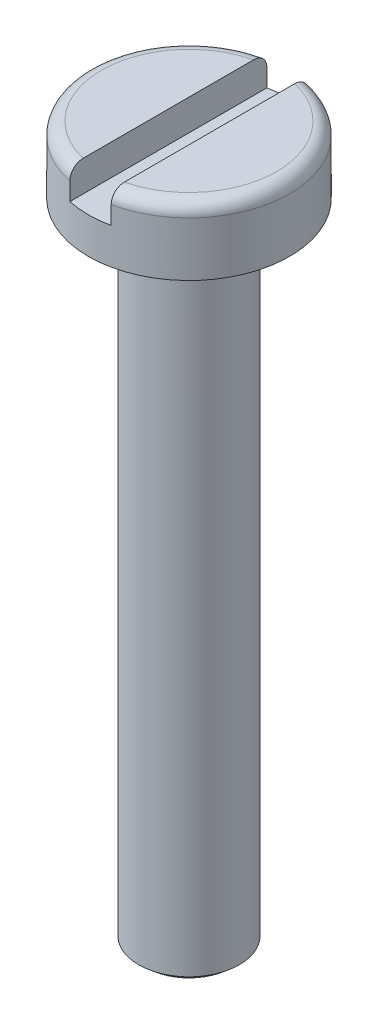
ISO-10303-21;
HEADER;
FILE_DESCRIPTION(('STEP AP214'),'2;1');
FILE_NAME('part.step','',(''),(''),'','','');
FILE_SCHEMA(('AUTOMOTIVE_DESIGN { 1 0 10303 214 1 1 1 1 }'));
ENDSEC;
DATA;
#1=APPLICATION_CONTEXT('core data for automotive mechanical design processes');
#2=APPLICATION_PROTOCOL_DEFINITION('international standard','automotive_design',2000,#1);
#3=PRODUCT_CONTEXT('',#1,'mechanical');
#4=PRODUCT('Part','Part','',(#3));
#5=PRODUCT_RELATED_PRODUCT_CATEGORY('part','',(#4));
#6=PRODUCT_DEFINITION_FORMATION('','',#4);
#7=PRODUCT_DEFINITION_CONTEXT('part definition',#1,'design');
#8=PRODUCT_DEFINITION('design','',#6,#7);
#9=PRODUCT_DEFINITION_SHAPE('','',#8);
#10=(LENGTH_UNIT() NAMED_UNIT(*) SI_UNIT(.MILLI.,.METRE.));
#11=(NAMED_UNIT(*) PLANE_ANGLE_UNIT() SI_UNIT($,.RADIAN.));
#12=(NAMED_UNIT(*) SI_UNIT($,.STERADIAN.) SOLID_ANGLE_UNIT());
#13=UNCERTAINTY_MEASURE_WITH_UNIT(LENGTH_MEASURE(1.E-05),#10,'distance_accuracy_value','');
#14=(GEOMETRIC_REPRESENTATION_CONTEXT(3) GLOBAL_UNCERTAINTY_ASSIGNED_CONTEXT((#13)) GLOBAL_UNIT_ASSIGNED_CONTEXT((#10,
#11,#12)) REPRESENTATION_CONTEXT('',''));
#15=CARTESIAN_POINT('',(0.,0.,0.));
#16=DIRECTION('',(0.,0.,1.));
#17=DIRECTION('',(1.,0.,0.));
#18=AXIS2_PLACEMENT_3D('',#15,#16,#17);
#19=CARTESIAN_POINT('',(0.,0.,0.));
#20=DIRECTION('',(0.,1.,0.));
#21=DIRECTION('',(0.,0.,1.));
#22=AXIS2_PLACEMENT_3D('',#19,#20,#21);
#23=PLANE('',#22);
#24=CARTESIAN_POINT('',(0.,0.,0.));
#25=DIRECTION('',(0.,1.,0.));
#26=DIRECTION('',(0.,0.,1.));
#27=AXIS2_PLACEMENT_3D('',#24,#25,#26);
#28=CIRCLE('',#27,3.9);
#29=CARTESIAN_POINT('',(0.,0.,3.9));
#30=VERTEX_POINT('',#29);
#31=EDGE_CURVE('E277',#30,#30,#28,.T.);
#32=ORIENTED_EDGE('',*,*,#31,.F.);
#33=EDGE_LOOP('',(#32));
#34=FACE_BOUND('',#33,.T.);
#35=CARTESIAN_POINT('',(0.,0.,0.));
#36=DIRECTION('',(0.,1.,0.));
#37=DIRECTION('',(0.,0.,1.));
#38=AXIS2_PLACEMENT_3D('',#35,#36,#37);
#39=CIRCLE('',#38,1.95);
#40=CARTESIAN_POINT('',(0.,0.,1.95));
#41=VERTEX_POINT('',#40);
#42=EDGE_CURVE('E202',#41,#41,#39,.F.);
#43=ORIENTED_EDGE('',*,*,#42,.F.);
#44=EDGE_LOOP('',(#43));
#45=FACE_BOUND('',#44,.T.);
#46=ADVANCED_FACE('F37',(#34,#45),#23,.F.);
#47=CARTESIAN_POINT('',(0.,2.6,0.));
#48=DIRECTION('',(0.,1.,0.));
#49=DIRECTION('',(0.,0.,1.));
#50=AXIS2_PLACEMENT_3D('',#47,#48,#49);
#51=PLANE('',#50);
#52=DIRECTION('',(0.,0.,1.));
#53=VECTOR('',#52,1.);
#54=CARTESIAN_POINT('',(-0.8,2.6,0.));
#55=LINE('',#54,#53);
#56=CARTESIAN_POINT('',(-0.8,2.6,-3.30454232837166));
#57=VERTEX_POINT('',#56);
#58=CARTESIAN_POINT('',(-0.8,2.6,3.30454232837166));
#59=VERTEX_POINT('',#58);
#60=EDGE_CURVE('E116',#57,#59,#55,.T.);
#61=ORIENTED_EDGE('',*,*,#60,.F.);
#62=CARTESIAN_POINT('',(0.,2.6,0.));
#63=DIRECTION('',(0.,1.,0.));
#64=DIRECTION('',(0.,0.,1.));
#65=AXIS2_PLACEMENT_3D('',#62,#63,#64);
#66=CIRCLE('',#65,3.4);
#67=EDGE_CURVE('E118',#57,#59,#66,.T.);
#68=ORIENTED_EDGE('',*,*,#67,.T.);
#69=EDGE_LOOP('',(#61,#68));
#70=FACE_BOUND('',#69,.T.);
#71=ADVANCED_FACE('F153',(#70),#51,.T.);
#72=CARTESIAN_POINT('',(0.,2.6,0.));
#73=DIRECTION('',(0.,-1.,0.));
#74=DIRECTION('',(0.,0.,-1.));
#75=AXIS2_PLACEMENT_3D('',#72,#73,#74);
#76=CYLINDRICAL_SURFACE('',#75,3.9);
#77=DIRECTION('',(0.,-1.,0.));
#78=VECTOR('',#77,1.);
#79=CARTESIAN_POINT('',(-0.8,2.6,3.81706693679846));
#80=LINE('',#79,#78);
#81=CARTESIAN_POINT('',(-0.799999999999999,1.4,3.81706693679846));
#82=VERTEX_POINT('',#81);
#83=CARTESIAN_POINT('',(-0.8,2.1,3.81706693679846));
#84=VERTEX_POINT('',#83);
#85=EDGE_CURVE('E282',#82,#84,#80,.F.);
#86=ORIENTED_EDGE('',*,*,#85,.T.);
#87=CARTESIAN_POINT('',(0.,2.1,0.));
#88=DIRECTION('',(0.,1.,0.));
#89=DIRECTION('',(0.,0.,1.));
#90=AXIS2_PLACEMENT_3D('',#87,#88,#89);
#91=CIRCLE('',#90,3.9);
#92=CARTESIAN_POINT('',(-0.8,2.1,-3.81706693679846));
#93=VERTEX_POINT('',#92);
#94=EDGE_CURVE('E168',#84,#93,#91,.F.);
#95=ORIENTED_EDGE('',*,*,#94,.T.);
#96=DIRECTION('',(0.,-1.,0.));
#97=VECTOR('',#96,1.);
#98=CARTESIAN_POINT('',(-0.8,2.6,-3.81706693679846));
#99=LINE('',#98,#97);
#100=CARTESIAN_POINT('',(-0.799999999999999,1.4,-3.81706693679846));
#101=VERTEX_POINT('',#100);
#102=EDGE_CURVE('E115',#93,#101,#99,.T.);
#103=ORIENTED_EDGE('',*,*,#102,.T.);
#104=CARTESIAN_POINT('',(0.,1.4,0.));
#105=DIRECTION('',(0.,-1.,0.));
#106=DIRECTION('',(0.,0.,-1.));
#107=AXIS2_PLACEMENT_3D('',#104,#105,#106);
#108=CIRCLE('',#107,3.9);
#109=CARTESIAN_POINT('',(0.8,1.4,-3.81706693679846));
#110=VERTEX_POINT('',#109);
#111=EDGE_CURVE('E105',#101,#110,#108,.T.);
#112=ORIENTED_EDGE('',*,*,#111,.T.);
#113=DIRECTION('',(0.,-1.,0.));
#114=VECTOR('',#113,1.);
#115=CARTESIAN_POINT('',(0.8,2.6,-3.81706693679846));
#116=LINE('',#115,#114);
#117=CARTESIAN_POINT('',(0.8,2.1,-3.81706693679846));
#118=VERTEX_POINT('',#117);
#119=EDGE_CURVE('E92',#110,#118,#116,.F.);
#120=ORIENTED_EDGE('',*,*,#119,.T.);
#121=CARTESIAN_POINT('',(0.,2.1,0.));
#122=DIRECTION('',(0.,1.,0.));
#123=DIRECTION('',(0.,0.,1.));
#124=AXIS2_PLACEMENT_3D('',#121,#122,#123);
#125=CIRCLE('',#124,3.9);
#126=CARTESIAN_POINT('',(0.8,2.1,3.81706693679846));
#127=VERTEX_POINT('',#126);
#128=EDGE_CURVE('E169',#118,#127,#125,.F.);
#129=ORIENTED_EDGE('',*,*,#128,.T.);
#130=DIRECTION('',(0.,-1.,0.));
#131=VECTOR('',#130,1.);
#132=CARTESIAN_POINT('',(0.8,2.6,3.81706693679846));
#133=LINE('',#132,#131);
#134=CARTESIAN_POINT('',(0.8,1.4,3.81706693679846));
#135=VERTEX_POINT('',#134);
#136=EDGE_CURVE('E98',#127,#135,#133,.T.);
#137=ORIENTED_EDGE('',*,*,#136,.T.);
#138=EDGE_CURVE('E108',#135,#82,#108,.T.);
#139=ORIENTED_EDGE('',*,*,#138,.T.);
#140=EDGE_LOOP('',(#86,#95,#103,#112,#120,#129,#137,#139));
#141=FACE_BOUND('',#140,.T.);
#142=ORIENTED_EDGE('',*,*,#31,.T.);
#143=EDGE_LOOP('',(#142));
#144=FACE_BOUND('',#143,.T.);
#145=ADVANCED_FACE('F112',(#141,#144),#76,.T.);
#146=DIRECTION('',(0.,0.,-1.));
#147=VECTOR('',#146,1.);
#148=CARTESIAN_POINT('',(0.8,2.6,0.));
#149=LINE('',#148,#147);
#150=CARTESIAN_POINT('',(0.8,2.6,3.30454232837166));
#151=VERTEX_POINT('',#150);
#152=CARTESIAN_POINT('',(0.8,2.6,-3.30454232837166));
#153=VERTEX_POINT('',#152);
#154=EDGE_CURVE('E120',#151,#153,#149,.T.);
#155=ORIENTED_EDGE('',*,*,#154,.F.);
#156=CARTESIAN_POINT('',(0.,2.6,0.));
#157=DIRECTION('',(0.,1.,0.));
#158=DIRECTION('',(0.,0.,1.));
#159=AXIS2_PLACEMENT_3D('',#156,#157,#158);
#160=CIRCLE('',#159,3.4);
#161=EDGE_CURVE('E170',#151,#153,#160,.T.);
#162=ORIENTED_EDGE('',*,*,#161,.T.);
#163=EDGE_LOOP('',(#155,#162));
#164=FACE_BOUND('',#163,.T.);
#165=ADVANCED_FACE('F148',(#164),#51,.T.);
#166=CARTESIAN_POINT('',(-0.8,1.4,-7.5));
#167=DIRECTION('',(0.,-1.,0.));
#168=DIRECTION('',(0.,0.,-1.));
#169=AXIS2_PLACEMENT_3D('',#166,#167,#168);
#170=PLANE('',#169);
#171=DIRECTION('',(0.,0.,1.));
#172=VECTOR('',#171,1.);
#173=CARTESIAN_POINT('',(0.8,1.4,-7.5));
#174=LINE('',#173,#172);
#175=EDGE_CURVE('E95',#110,#135,#174,.T.);
#176=ORIENTED_EDGE('',*,*,#175,.F.);
#177=ORIENTED_EDGE('',*,*,#111,.F.);
#178=DIRECTION('',(0.,0.,1.));
#179=VECTOR('',#178,1.);
#180=CARTESIAN_POINT('',(-0.8,1.4,-7.5));
#181=LINE('',#180,#179);
#182=EDGE_CURVE('E109',#101,#82,#181,.T.);
#183=ORIENTED_EDGE('',*,*,#182,.T.);
#184=ORIENTED_EDGE('',*,*,#138,.F.);
#185=EDGE_LOOP('',(#176,#177,#183,#184));
#186=FACE_BOUND('',#185,.T.);
#187=ADVANCED_FACE('F103',(#186),#170,.F.);
#188=CARTESIAN_POINT('',(-0.8,1.4,-7.5));
#189=DIRECTION('',(-1.,0.,0.));
#190=DIRECTION('',(0.,0.,1.));
#191=AXIS2_PLACEMENT_3D('',#188,#189,#190);
#192=PLANE('',#191);
#193=ORIENTED_EDGE('',*,*,#60,.T.);
#194=CARTESIAN_POINT('',(-0.8,2.6,3.30454232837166));
#195=CARTESIAN_POINT('',(-0.8,2.6000222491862,3.33395420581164));
#196=CARTESIAN_POINT('',(-0.8,2.59754961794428,3.36336675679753));
#197=CARTESIAN_POINT('',(-0.8,2.58774767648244,3.42137568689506));
#198=CARTESIAN_POINT('',(-0.8,2.58041761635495,3.44997193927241));
#199=CARTESIAN_POINT('',(-0.8,2.56102510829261,3.50554657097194));
#200=CARTESIAN_POINT('',(-0.8,2.54895833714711,3.53252344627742));
#201=CARTESIAN_POINT('',(-0.8,2.52040096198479,3.58401151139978));
#202=CARTESIAN_POINT('',(-0.8,2.50391247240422,3.60852387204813));
#203=CARTESIAN_POINT('',(-0.8,2.46724042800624,3.65396643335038));
#204=CARTESIAN_POINT('',(-0.8,2.4471198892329,3.67494745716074));
#205=CARTESIAN_POINT('',(-0.8,2.40355936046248,3.713138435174));
#206=CARTESIAN_POINT('',(-0.8,2.38011884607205,3.73034779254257));
#207=CARTESIAN_POINT('',(-0.8,2.33118878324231,3.76007128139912));
#208=CARTESIAN_POINT('',(-0.8,2.3057605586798,3.77268652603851));
#209=CARTESIAN_POINT('',(-0.8,2.2531279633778,3.79336745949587));
#210=CARTESIAN_POINT('',(-0.8,2.22592524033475,3.80143730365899));
#211=CARTESIAN_POINT('',(-0.8,2.18208517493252,3.81041782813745));
#212=CARTESIAN_POINT('',(-0.8,2.1657558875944,3.81291002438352));
#213=CARTESIAN_POINT('',(-0.8,2.13295366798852,3.81623395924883));
#214=CARTESIAN_POINT('',(-0.8,2.11648098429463,3.81706815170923));
#215=CARTESIAN_POINT('',(-0.8,2.1000000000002,3.81706693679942));
#216=B_SPLINE_CURVE_WITH_KNOTS('',3,(#194,#195,#196,#197,#198,#199,#200,#201,#202,#203,#204,
#205,#206,#207,#208,#209,#210,#211,#212,#213,#214,#215),.UNSPECIFIED.,.F.,.F.,(4,2,2,2,2,2,2,2,
2,2,4),(0.,0.0881337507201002,0.17628111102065,0.264509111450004,0.352694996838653,
0.439476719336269,0.526272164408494,0.611021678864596,0.695693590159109,0.745172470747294,
0.794578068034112),.UNSPECIFIED.);
#217=EDGE_CURVE('E133',#59,#84,#216,.T.);
#218=ORIENTED_EDGE('',*,*,#217,.T.);
#219=ORIENTED_EDGE('',*,*,#85,.F.);
#220=ORIENTED_EDGE('',*,*,#182,.F.);
#221=ORIENTED_EDGE('',*,*,#102,.F.);
#222=CARTESIAN_POINT('',(-0.8,2.1,-3.81706693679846));
#223=CARTESIAN_POINT('',(-0.8,2.12767947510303,-3.81709299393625));
#224=CARTESIAN_POINT('',(-0.8,2.1553487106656,-3.81472020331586));
#225=CARTESIAN_POINT('',(-0.8,2.20986210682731,-3.8053728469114));
#226=CARTESIAN_POINT('',(-0.8,2.23670732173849,-3.79840444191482));
#227=CARTESIAN_POINT('',(-0.8,2.28885396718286,-3.78005810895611));
#228=CARTESIAN_POINT('',(-0.8,2.31415493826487,-3.7686788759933));
#229=CARTESIAN_POINT('',(-0.8,2.36250793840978,-3.74187133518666));
#230=CARTESIAN_POINT('',(-0.8,2.38556002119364,-3.72644312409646));
#231=CARTESIAN_POINT('',(-0.8,2.42898655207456,-3.69185239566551));
#232=CARTESIAN_POINT('',(-0.8,2.44933670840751,-3.67265940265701));
#233=CARTESIAN_POINT('',(-0.8,2.48660638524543,-3.63118739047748));
#234=CARTESIAN_POINT('',(-0.8,2.50352520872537,-3.60890774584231));
#235=CARTESIAN_POINT('',(-0.8,2.53382381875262,-3.56141613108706));
#236=CARTESIAN_POINT('',(-0.8,2.54712400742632,-3.53615344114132));
#237=CARTESIAN_POINT('',(-0.8,2.56940261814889,-3.48379107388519));
#238=CARTESIAN_POINT('',(-0.8,2.57838182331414,-3.45669173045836));
#239=CARTESIAN_POINT('',(-0.8,2.59005875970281,-3.40868099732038));
#240=CARTESIAN_POINT('',(-0.8,2.59378680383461,-3.38801335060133));
#241=CARTESIAN_POINT('',(-0.8,2.59875736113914,-3.34641306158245));
#242=CARTESIAN_POINT('',(-0.8,2.60000364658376,-3.32548087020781));
#243=CARTESIAN_POINT('',(-0.8,2.6,-3.30454232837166));
#244=B_SPLINE_CURVE_WITH_KNOTS('',3,(#222,#223,#224,#225,#226,#227,#228,#229,#230,#231,#232,
#233,#234,#235,#236,#237,#238,#239,#240,#241,#242,#243),.UNSPECIFIED.,.F.,.F.,(4,2,2,2,2,2,2,2,
2,2,4),(0.,0.0829216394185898,0.165732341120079,0.248567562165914,0.33140080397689,
0.414934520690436,0.498485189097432,0.58374741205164,0.668994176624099,0.731855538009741,
0.79462127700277),.UNSPECIFIED.);
#245=EDGE_CURVE('E126',#93,#57,#244,.T.);
#246=ORIENTED_EDGE('',*,*,#245,.T.);
#247=EDGE_LOOP('',(#193,#218,#219,#220,#221,#246));
#248=FACE_BOUND('',#247,.T.);
#249=ADVANCED_FACE('F141',(#248),#192,.F.);
#250=CARTESIAN_POINT('',(0.8,1.4,-7.5));
#251=DIRECTION('',(1.,0.,0.));
#252=DIRECTION('',(0.,0.,-1.));
#253=AXIS2_PLACEMENT_3D('',#250,#251,#252);
#254=PLANE('',#253);
#255=ORIENTED_EDGE('',*,*,#154,.T.);
#256=CARTESIAN_POINT('',(0.8,2.6,-3.30454232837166));
#257=CARTESIAN_POINT('',(0.8,2.6000222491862,-3.33395420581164));
#258=CARTESIAN_POINT('',(0.8,2.59754961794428,-3.36336675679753));
#259=CARTESIAN_POINT('',(0.8,2.58774767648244,-3.42137568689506));
#260=CARTESIAN_POINT('',(0.8,2.58041761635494,-3.44997193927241));
#261=CARTESIAN_POINT('',(0.8,2.56102510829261,-3.50554657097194));
#262=CARTESIAN_POINT('',(0.8,2.54895833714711,-3.53252344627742));
#263=CARTESIAN_POINT('',(0.8,2.52040096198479,-3.58401151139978));
#264=CARTESIAN_POINT('',(0.8,2.50391247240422,-3.60852387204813));
#265=CARTESIAN_POINT('',(0.8,2.46724042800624,-3.65396643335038));
#266=CARTESIAN_POINT('',(0.8,2.4471198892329,-3.67494745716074));
#267=CARTESIAN_POINT('',(0.8,2.40355936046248,-3.713138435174));
#268=CARTESIAN_POINT('',(0.8,2.38011884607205,-3.73034779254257));
#269=CARTESIAN_POINT('',(0.8,2.33118878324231,-3.76007128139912));
#270=CARTESIAN_POINT('',(0.8,2.3057605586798,-3.77268652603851));
#271=CARTESIAN_POINT('',(0.8,2.2531279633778,-3.79336745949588));
#272=CARTESIAN_POINT('',(0.8,2.22592524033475,-3.801437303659));
#273=CARTESIAN_POINT('',(0.8,2.18208517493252,-3.81041782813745));
#274=CARTESIAN_POINT('',(0.8,2.1657558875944,-3.81291002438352));
#275=CARTESIAN_POINT('',(0.8,2.13295366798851,-3.81623395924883));
#276=CARTESIAN_POINT('',(0.8,2.11648098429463,-3.81706815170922));
#277=CARTESIAN_POINT('',(0.8,2.1000000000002,-3.81706693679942));
#278=B_SPLINE_CURVE_WITH_KNOTS('',3,(#256,#257,#258,#259,#260,#261,#262,#263,#264,#265,#266,
#267,#268,#269,#270,#271,#272,#273,#274,#275,#276,#277),.UNSPECIFIED.,.F.,.F.,(4,2,2,2,2,2,2,2,
2,2,4),(0.,0.0881337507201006,0.17628111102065,0.264509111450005,0.352694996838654,
0.439476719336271,0.526272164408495,0.611021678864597,0.69569359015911,0.745172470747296,
0.794578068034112),.UNSPECIFIED.);
#279=EDGE_CURVE('E52',#153,#118,#278,.T.);
#280=ORIENTED_EDGE('',*,*,#279,.T.);
#281=ORIENTED_EDGE('',*,*,#119,.F.);
#282=ORIENTED_EDGE('',*,*,#175,.T.);
#283=ORIENTED_EDGE('',*,*,#136,.F.);
#284=CARTESIAN_POINT('',(0.8,2.1,3.81706693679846));
#285=CARTESIAN_POINT('',(0.8,2.12767947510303,3.81709299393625));
#286=CARTESIAN_POINT('',(0.8,2.1553487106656,3.81472020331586));
#287=CARTESIAN_POINT('',(0.8,2.20986210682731,3.8053728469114));
#288=CARTESIAN_POINT('',(0.8,2.23670732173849,3.79840444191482));
#289=CARTESIAN_POINT('',(0.8,2.28885396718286,3.78005810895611));
#290=CARTESIAN_POINT('',(0.8,2.31415493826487,3.7686788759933));
#291=CARTESIAN_POINT('',(0.8,2.36250793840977,3.74187133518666));
#292=CARTESIAN_POINT('',(0.8,2.38556002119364,3.72644312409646));
#293=CARTESIAN_POINT('',(0.8,2.42898655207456,3.69185239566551));
#294=CARTESIAN_POINT('',(0.8,2.4493367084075,3.67265940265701));
#295=CARTESIAN_POINT('',(0.8,2.48660638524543,3.63118739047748));
#296=CARTESIAN_POINT('',(0.8,2.50352520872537,3.60890774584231));
#297=CARTESIAN_POINT('',(0.8,2.53382381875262,3.56141613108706));
#298=CARTESIAN_POINT('',(0.8,2.54712400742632,3.53615344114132));
#299=CARTESIAN_POINT('',(0.8,2.56940261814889,3.48379107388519));
#300=CARTESIAN_POINT('',(0.8,2.57838182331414,3.45669173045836));
#301=CARTESIAN_POINT('',(0.8,2.59005875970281,3.40868099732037));
#302=CARTESIAN_POINT('',(0.8,2.59378680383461,3.38801335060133));
#303=CARTESIAN_POINT('',(0.8,2.59875736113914,3.34641306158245));
#304=CARTESIAN_POINT('',(0.8,2.60000364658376,3.32548087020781));
#305=CARTESIAN_POINT('',(0.8,2.6,3.30454232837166));
#306=B_SPLINE_CURVE_WITH_KNOTS('',3,(#284,#285,#286,#287,#288,#289,#290,#291,#292,#293,#294,
#295,#296,#297,#298,#299,#300,#301,#302,#303,#304,#305),.UNSPECIFIED.,.F.,.F.,(4,2,2,2,2,2,2,2,
2,2,4),(0.,0.0829216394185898,0.16573234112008,0.248567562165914,0.331400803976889,
0.414934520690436,0.498485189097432,0.583747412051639,0.668994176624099,0.731855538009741,
0.79462127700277),.UNSPECIFIED.);
#307=EDGE_CURVE('E60',#127,#151,#306,.T.);
#308=ORIENTED_EDGE('',*,*,#307,.T.);
#309=EDGE_LOOP('',(#255,#280,#281,#282,#283,#308));
#310=FACE_BOUND('',#309,.T.);
#311=ADVANCED_FACE('F94',(#310),#254,.F.);
#312=CARTESIAN_POINT('',(0.,2.1,0.));
#313=DIRECTION('',(0.,1.,0.));
#314=DIRECTION('',(0.,0.,1.));
#315=AXIS2_PLACEMENT_3D('',#312,#313,#314);
#316=TOROIDAL_SURFACE('',#315,3.4,0.5);
#317=ORIENTED_EDGE('',*,*,#245,.F.);
#318=ORIENTED_EDGE('',*,*,#94,.F.);
#319=ORIENTED_EDGE('',*,*,#217,.F.);
#320=ORIENTED_EDGE('',*,*,#67,.F.);
#321=EDGE_LOOP('',(#317,#318,#319,#320));
#322=FACE_BOUND('',#321,.T.);
#323=ADVANCED_FACE('F138',(#322),#316,.T.);
#324=CARTESIAN_POINT('',(0.,2.1,0.));
#325=DIRECTION('',(0.,1.,0.));
#326=DIRECTION('',(0.,0.,1.));
#327=AXIS2_PLACEMENT_3D('',#324,#325,#326);
#328=TOROIDAL_SURFACE('',#327,3.4,0.5);
#329=ORIENTED_EDGE('',*,*,#307,.F.);
#330=ORIENTED_EDGE('',*,*,#128,.F.);
#331=ORIENTED_EDGE('',*,*,#279,.F.);
#332=ORIENTED_EDGE('',*,*,#161,.F.);
#333=EDGE_LOOP('',(#329,#330,#331,#332));
#334=FACE_BOUND('',#333,.T.);
#335=ADVANCED_FACE('F182',(#334),#328,.T.);
#336=CARTESIAN_POINT('',(0.,-25.,0.));
#337=DIRECTION('',(0.,1.,0.));
#338=DIRECTION('',(0.,0.,1.));
#339=AXIS2_PLACEMENT_3D('',#336,#337,#338);
#340=CYLINDRICAL_SURFACE('',#339,1.95);
#341=CARTESIAN_POINT('',(0.,-24.75,0.));
#342=DIRECTION('',(0.,-1.,0.));
#343=DIRECTION('',(0.,0.,-1.));
#344=AXIS2_PLACEMENT_3D('',#341,#342,#343);
#345=CIRCLE('',#344,1.95);
#346=CARTESIAN_POINT('',(0.,-24.75,-1.95));
#347=VERTEX_POINT('',#346);
#348=EDGE_CURVE('E11',#347,#347,#345,.F.);
#349=ORIENTED_EDGE('',*,*,#348,.T.);
#350=EDGE_LOOP('',(#349));
#351=FACE_BOUND('',#350,.T.);
#352=ORIENTED_EDGE('',*,*,#42,.T.);
#353=EDGE_LOOP('',(#352));
#354=FACE_BOUND('',#353,.T.);
#355=ADVANCED_FACE('F187',(#351,#354),#340,.T.);
#356=CARTESIAN_POINT('',(0.,-25.,0.));
#357=DIRECTION('',(0.,-1.,0.));
#358=DIRECTION('',(0.,0.,-1.));
#359=AXIS2_PLACEMENT_3D('',#356,#357,#358);
#360=PLANE('',#359);
#361=CARTESIAN_POINT('',(0.,-25.,0.));
#362=DIRECTION('',(0.,-1.,0.));
#363=DIRECTION('',(0.,0.,-1.));
#364=AXIS2_PLACEMENT_3D('',#361,#362,#363);
#365=CIRCLE('',#364,1.65206160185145);
#366=CARTESIAN_POINT('',(0.,-25.,-1.65206160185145));
#367=VERTEX_POINT('',#366);
#368=EDGE_CURVE('E45',#367,#367,#365,.T.);
#369=ORIENTED_EDGE('',*,*,#368,.T.);
#370=EDGE_LOOP('',(#369));
#371=FACE_BOUND('',#370,.T.);
#372=ADVANCED_FACE('F191',(#371),#360,.T.);
#373=CARTESIAN_POINT('',(0.,-25.,0.));
#374=DIRECTION('',(0.,1.,0.));
#375=DIRECTION('',(0.,0.,1.));
#376=AXIS2_PLACEMENT_3D('',#373,#374,#375);
#377=CONICAL_SURFACE('',#376,1.65206160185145,0.872664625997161);
#378=ORIENTED_EDGE('',*,*,#348,.F.);
#379=EDGE_LOOP('',(#378));
#380=FACE_BOUND('',#379,.T.);
#381=ORIENTED_EDGE('',*,*,#368,.F.);
#382=EDGE_LOOP('',(#381));
#383=FACE_BOUND('',#382,.T.);
#384=ADVANCED_FACE('F39',(#380,#383),#377,.T.);
#385=CLOSED_SHELL('',(#46,#71,#145,#165,#187,#249,#311,#323,#335,#355,#372,#384));
#386=MANIFOLD_SOLID_BREP('B2',#385);
#387=ADVANCED_BREP_SHAPE_REPRESENTATION('',(#18,#386),#14);
#388=SHAPE_DEFINITION_REPRESENTATION(#9,#387);
ENDSEC;
END-ISO-10303-21;
